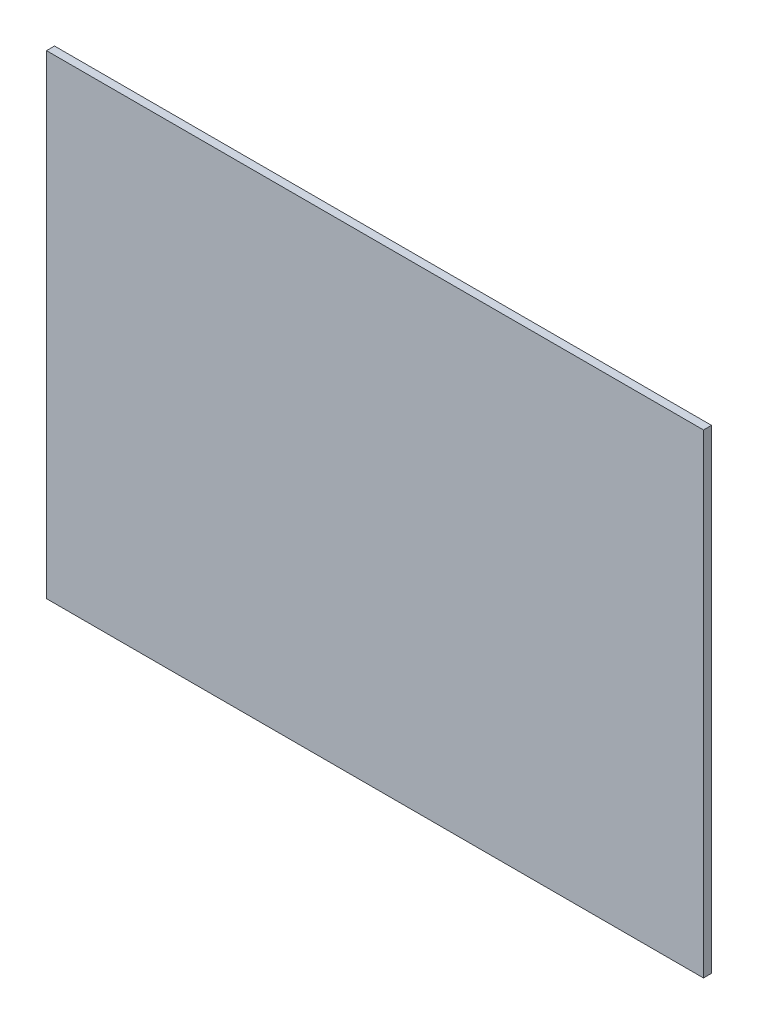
from build123d import *

# Parameters (mm, degrees)
SKETCH1_W      = 163.9499044
SKETCH1_H      = 118.446858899
EXTRUDE1_DEPTH = 2


with BuildPart() as part:
    # Sketch1 → Extrude1 (new body)
    with BuildSketch(Plane.XY):
        with Locations((-24.14092872, 13.720383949)):
            Rectangle(SKETCH1_W, SKETCH1_H)
    extrude(amount=EXTRUDE1_DEPTH)


solid = part.part
